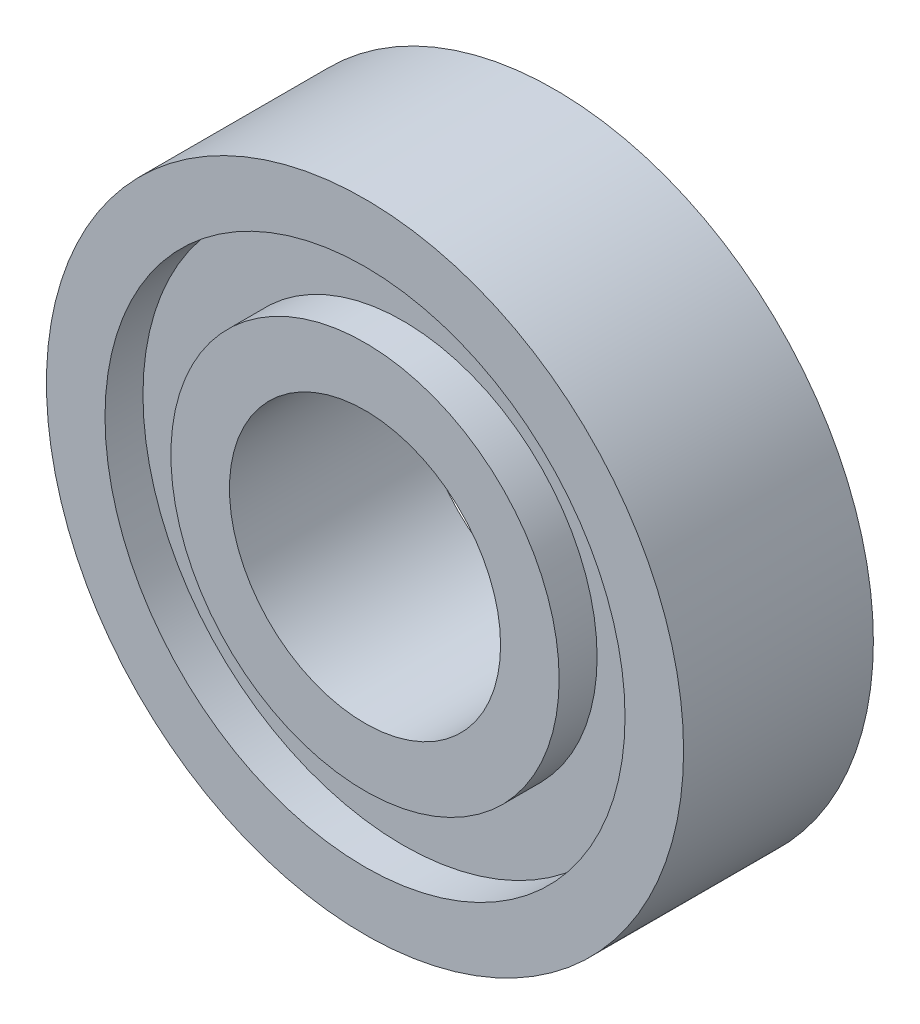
from build123d import *

# Parameters (mm, degrees)
SKIZZE1_R                       = 23.5
SKIZZE1_R_2                     = 19.18
AUFSATZ_LINEAR_AUSTRAGEN1_DEPTH = 7
SKIZZE2_R                       = 14.32
SKIZZE2_R_2                     = 10
AUFSATZ_LINEAR_AUSTRAGEN2_DEPTH = 7
SKIZZE3_R                       = 19.18
SKIZZE3_R_2                     = 14.32
AUFSATZ_LINEAR_AUSTRAGEN3_DEPTH = 4.2


with BuildPart() as part:
    # Skizze1 → Aufsatz-Linear austragen1 (new, symmetric)
    with BuildSketch(Plane.XY):
        Circle(SKIZZE1_R)
        Circle(SKIZZE1_R_2, mode=Mode.SUBTRACT)
    extrude(amount=AUFSATZ_LINEAR_AUSTRAGEN1_DEPTH, both=True)



with BuildPart() as body_2:
    # Skizze2 → Aufsatz-Linear austragen2 (new, symmetric)
    with BuildSketch(Plane.XY):
        Circle(SKIZZE2_R)
        Circle(SKIZZE2_R_2, mode=Mode.SUBTRACT)
    extrude(amount=AUFSATZ_LINEAR_AUSTRAGEN2_DEPTH, both=True)


with BuildPart() as part_1:
    add(part.part)

    add(body_2.part)  # Aufsatz-Linear austragen3 merges body 2
    # Skizze3 → Aufsatz-Linear austragen3 (add, symmetric)
    with BuildSketch(Plane.XY):
        Circle(SKIZZE3_R)
        Circle(SKIZZE3_R_2, mode=Mode.SUBTRACT)
    extrude(amount=AUFSATZ_LINEAR_AUSTRAGEN3_DEPTH, both=True)


solid = part_1.part
